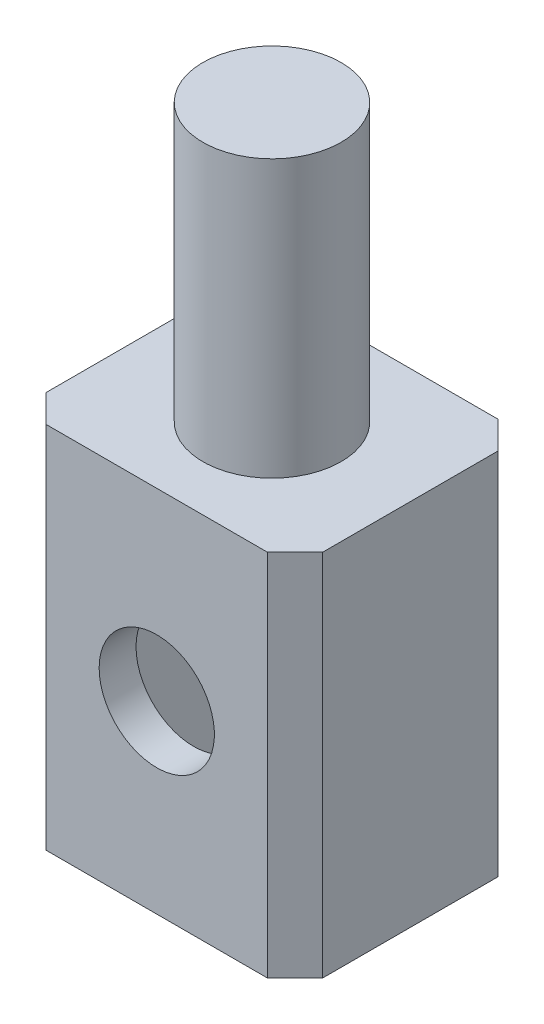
ISO-10303-21;
HEADER;
FILE_DESCRIPTION(('STEP AP214'),'2;1');
FILE_NAME('part.step','',(''),(''),'','','');
FILE_SCHEMA(('AUTOMOTIVE_DESIGN { 1 0 10303 214 1 1 1 1 }'));
ENDSEC;
DATA;
#1=APPLICATION_CONTEXT('core data for automotive mechanical design processes');
#2=APPLICATION_PROTOCOL_DEFINITION('international standard','automotive_design',2000,#1);
#3=PRODUCT_CONTEXT('',#1,'mechanical');
#4=PRODUCT('Part','Part','',(#3));
#5=PRODUCT_RELATED_PRODUCT_CATEGORY('part','',(#4));
#6=PRODUCT_DEFINITION_FORMATION('','',#4);
#7=PRODUCT_DEFINITION_CONTEXT('part definition',#1,'design');
#8=PRODUCT_DEFINITION('design','',#6,#7);
#9=PRODUCT_DEFINITION_SHAPE('','',#8);
#10=(LENGTH_UNIT() NAMED_UNIT(*) SI_UNIT(.MILLI.,.METRE.));
#11=(NAMED_UNIT(*) PLANE_ANGLE_UNIT() SI_UNIT($,.RADIAN.));
#12=(NAMED_UNIT(*) SI_UNIT($,.STERADIAN.) SOLID_ANGLE_UNIT());
#13=UNCERTAINTY_MEASURE_WITH_UNIT(LENGTH_MEASURE(1.E-05),#10,'distance_accuracy_value','');
#14=(GEOMETRIC_REPRESENTATION_CONTEXT(3) GLOBAL_UNCERTAINTY_ASSIGNED_CONTEXT((#13)) GLOBAL_UNIT_ASSIGNED_CONTEXT((#10,
#11,#12)) REPRESENTATION_CONTEXT('',''));
#15=CARTESIAN_POINT('',(0.,0.,0.));
#16=DIRECTION('',(0.,0.,1.));
#17=DIRECTION('',(1.,0.,0.));
#18=AXIS2_PLACEMENT_3D('',#15,#16,#17);
#19=CARTESIAN_POINT('',(0.,0.,0.));
#20=DIRECTION('',(0.,-1.,0.));
#21=DIRECTION('',(0.,0.,-1.));
#22=AXIS2_PLACEMENT_3D('',#19,#20,#21);
#23=PLANE('',#22);
#24=DIRECTION('',(1.,0.,0.));
#25=VECTOR('',#24,1.);
#26=CARTESIAN_POINT('',(0.,0.,0.));
#27=LINE('',#26,#25);
#28=CARTESIAN_POINT('',(7.61999999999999,0.,0.));
#29=VERTEX_POINT('',#28);
#30=CARTESIAN_POINT('',(68.5799999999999,0.,0.));
#31=VERTEX_POINT('',#30);
#32=EDGE_CURVE('E164',#29,#31,#27,.T.);
#33=ORIENTED_EDGE('',*,*,#32,.F.);
#34=DIRECTION('',(0.707106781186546,0.,0.707106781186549));
#35=VECTOR('',#34,1.);
#36=CARTESIAN_POINT('',(3.81000000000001,0.,-3.80999999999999));
#37=LINE('',#36,#35);
#38=CARTESIAN_POINT('',(0.,0.,-7.62000000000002));
#39=VERTEX_POINT('',#38);
#40=EDGE_CURVE('E214',#29,#39,#37,.F.);
#41=ORIENTED_EDGE('',*,*,#40,.T.);
#42=DIRECTION('',(0.,0.,1.));
#43=VECTOR('',#42,1.);
#44=CARTESIAN_POINT('',(0.,0.,0.));
#45=LINE('',#44,#43);
#46=CARTESIAN_POINT('',(0.,0.,-55.88));
#47=VERTEX_POINT('',#46);
#48=EDGE_CURVE('E160',#47,#39,#45,.T.);
#49=ORIENTED_EDGE('',*,*,#48,.F.);
#50=DIRECTION('',(-0.707106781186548,0.,0.707106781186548));
#51=VECTOR('',#50,1.);
#52=CARTESIAN_POINT('',(-27.94,0.,-27.94));
#53=LINE('',#52,#51);
#54=CARTESIAN_POINT('',(7.62000000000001,0.,-63.5));
#55=VERTEX_POINT('',#54);
#56=EDGE_CURVE('E212',#47,#55,#53,.F.);
#57=ORIENTED_EDGE('',*,*,#56,.T.);
#58=DIRECTION('',(-1.,0.,0.));
#59=VECTOR('',#58,1.);
#60=CARTESIAN_POINT('',(0.,0.,-63.5));
#61=LINE('',#60,#59);
#62=CARTESIAN_POINT('',(68.58,0.,-63.5));
#63=VERTEX_POINT('',#62);
#64=EDGE_CURVE('E190',#63,#55,#61,.T.);
#65=ORIENTED_EDGE('',*,*,#64,.F.);
#66=DIRECTION('',(-0.707106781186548,0.,-0.707106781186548));
#67=VECTOR('',#66,1.);
#68=CARTESIAN_POINT('',(66.04,0.,-66.04));
#69=LINE('',#68,#67);
#70=CARTESIAN_POINT('',(76.2,0.,-55.88));
#71=VERTEX_POINT('',#70);
#72=EDGE_CURVE('E210',#63,#71,#69,.F.);
#73=ORIENTED_EDGE('',*,*,#72,.T.);
#74=DIRECTION('',(0.,0.,-1.));
#75=VECTOR('',#74,1.);
#76=CARTESIAN_POINT('',(76.2,0.,0.));
#77=LINE('',#76,#75);
#78=CARTESIAN_POINT('',(76.2,0.,-7.62000000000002));
#79=VERTEX_POINT('',#78);
#80=EDGE_CURVE('E199',#79,#71,#77,.T.);
#81=ORIENTED_EDGE('',*,*,#80,.F.);
#82=DIRECTION('',(0.707106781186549,0.,-0.707106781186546));
#83=VECTOR('',#82,1.);
#84=CARTESIAN_POINT('',(34.2899999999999,0.,34.29));
#85=LINE('',#84,#83);
#86=EDGE_CURVE('E208',#79,#31,#85,.F.);
#87=ORIENTED_EDGE('',*,*,#86,.T.);
#88=EDGE_LOOP('',(#33,#41,#49,#57,#65,#73,#81,#87));
#89=FACE_BOUND('',#88,.T.);
#90=DIRECTION('',(-1.,0.,0.));
#91=VECTOR('',#90,1.);
#92=CARTESIAN_POINT('',(0.,0.,-53.34));
#93=LINE('',#92,#91);
#94=CARTESIAN_POINT('',(66.04,0.,-53.34));
#95=VERTEX_POINT('',#94);
#96=CARTESIAN_POINT('',(10.16,0.,-53.34));
#97=VERTEX_POINT('',#96);
#98=EDGE_CURVE('E155',#95,#97,#93,.T.);
#99=ORIENTED_EDGE('',*,*,#98,.T.);
#100=DIRECTION('',(0.,0.,1.));
#101=VECTOR('',#100,1.);
#102=CARTESIAN_POINT('',(10.16,0.,0.));
#103=LINE('',#102,#101);
#104=CARTESIAN_POINT('',(10.16,0.,-10.16));
#105=VERTEX_POINT('',#104);
#106=EDGE_CURVE('E177',#97,#105,#103,.T.);
#107=ORIENTED_EDGE('',*,*,#106,.T.);
#108=DIRECTION('',(1.,0.,0.));
#109=VECTOR('',#108,1.);
#110=CARTESIAN_POINT('',(0.,0.,-10.16));
#111=LINE('',#110,#109);
#112=CARTESIAN_POINT('',(66.04,0.,-10.16));
#113=VERTEX_POINT('',#112);
#114=EDGE_CURVE('E159',#105,#113,#111,.T.);
#115=ORIENTED_EDGE('',*,*,#114,.T.);
#116=DIRECTION('',(0.,0.,-1.));
#117=VECTOR('',#116,1.);
#118=CARTESIAN_POINT('',(66.04,0.,0.));
#119=LINE('',#118,#117);
#120=EDGE_CURVE('E182',#113,#95,#119,.T.);
#121=ORIENTED_EDGE('',*,*,#120,.T.);
#122=EDGE_LOOP('',(#99,#107,#115,#121));
#123=FACE_BOUND('',#122,.T.);
#124=ADVANCED_FACE('F44',(#89,#123),#23,.T.);
#125=CARTESIAN_POINT('',(0.,101.6,0.));
#126=DIRECTION('',(1.,0.,0.));
#127=DIRECTION('',(0.,0.,-1.));
#128=AXIS2_PLACEMENT_3D('',#125,#126,#127);
#129=PLANE('',#128);
#130=ORIENTED_EDGE('',*,*,#48,.T.);
#131=DIRECTION('',(0.,1.,0.));
#132=VECTOR('',#131,1.);
#133=CARTESIAN_POINT('',(0.,101.6,-7.62000000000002));
#134=LINE('',#133,#132);
#135=CARTESIAN_POINT('',(0.,101.6,-7.62000000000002));
#136=VERTEX_POINT('',#135);
#137=EDGE_CURVE('E219',#39,#136,#134,.T.);
#138=ORIENTED_EDGE('',*,*,#137,.T.);
#139=DIRECTION('',(0.,0.,1.));
#140=VECTOR('',#139,1.);
#141=CARTESIAN_POINT('',(0.,101.6,0.));
#142=LINE('',#141,#140);
#143=CARTESIAN_POINT('',(0.,101.6,-55.88));
#144=VERTEX_POINT('',#143);
#145=EDGE_CURVE('E186',#144,#136,#142,.T.);
#146=ORIENTED_EDGE('',*,*,#145,.F.);
#147=DIRECTION('',(0.,-1.,0.));
#148=VECTOR('',#147,1.);
#149=CARTESIAN_POINT('',(0.,101.6,-55.88));
#150=LINE('',#149,#148);
#151=EDGE_CURVE('E216',#144,#47,#150,.T.);
#152=ORIENTED_EDGE('',*,*,#151,.T.);
#153=EDGE_LOOP('',(#130,#138,#146,#152));
#154=FACE_BOUND('',#153,.T.);
#155=ADVANCED_FACE('F257',(#154),#129,.F.);
#156=CARTESIAN_POINT('',(0.,101.6,0.));
#157=DIRECTION('',(0.,0.,-1.));
#158=DIRECTION('',(-1.,0.,0.));
#159=AXIS2_PLACEMENT_3D('',#156,#157,#158);
#160=PLANE('',#159);
#161=CARTESIAN_POINT('',(38.1,50.8,0.));
#162=DIRECTION('',(0.,0.,-1.));
#163=DIRECTION('',(-1.,0.,0.));
#164=AXIS2_PLACEMENT_3D('',#161,#162,#163);
#165=CIRCLE('',#164,15.875);
#166=CARTESIAN_POINT('',(22.225,50.8,0.));
#167=VERTEX_POINT('',#166);
#168=EDGE_CURVE('E433',#167,#167,#165,.F.);
#169=ORIENTED_EDGE('',*,*,#168,.F.);
#170=EDGE_LOOP('',(#169));
#171=FACE_BOUND('',#170,.T.);
#172=DIRECTION('',(1.,0.,0.));
#173=VECTOR('',#172,1.);
#174=CARTESIAN_POINT('',(0.,101.6,0.));
#175=LINE('',#174,#173);
#176=CARTESIAN_POINT('',(7.61999999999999,101.6,0.));
#177=VERTEX_POINT('',#176);
#178=CARTESIAN_POINT('',(68.5799999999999,101.6,0.));
#179=VERTEX_POINT('',#178);
#180=EDGE_CURVE('E189',#177,#179,#175,.T.);
#181=ORIENTED_EDGE('',*,*,#180,.F.);
#182=DIRECTION('',(0.,-1.,0.));
#183=VECTOR('',#182,1.);
#184=CARTESIAN_POINT('',(7.61999999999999,101.6,0.));
#185=LINE('',#184,#183);
#186=EDGE_CURVE('E205',#177,#29,#185,.T.);
#187=ORIENTED_EDGE('',*,*,#186,.T.);
#188=ORIENTED_EDGE('',*,*,#32,.T.);
#189=DIRECTION('',(0.,1.,0.));
#190=VECTOR('',#189,1.);
#191=CARTESIAN_POINT('',(68.58,101.6,0.));
#192=LINE('',#191,#190);
#193=EDGE_CURVE('E203',#31,#179,#192,.T.);
#194=ORIENTED_EDGE('',*,*,#193,.T.);
#195=EDGE_LOOP('',(#181,#187,#188,#194));
#196=FACE_BOUND('',#195,.T.);
#197=ADVANCED_FACE('F265',(#171,#196),#160,.F.);
#198=CARTESIAN_POINT('',(76.2,101.6,0.));
#199=DIRECTION('',(-1.,0.,0.));
#200=DIRECTION('',(0.,0.,1.));
#201=AXIS2_PLACEMENT_3D('',#198,#199,#200);
#202=PLANE('',#201);
#203=ORIENTED_EDGE('',*,*,#80,.T.);
#204=DIRECTION('',(0.,1.,0.));
#205=VECTOR('',#204,1.);
#206=CARTESIAN_POINT('',(76.2,101.6,-55.88));
#207=LINE('',#206,#205);
#208=CARTESIAN_POINT('',(76.2,101.6,-55.88));
#209=VERTEX_POINT('',#208);
#210=EDGE_CURVE('E11',#71,#209,#207,.T.);
#211=ORIENTED_EDGE('',*,*,#210,.T.);
#212=DIRECTION('',(0.,0.,-1.));
#213=VECTOR('',#212,1.);
#214=CARTESIAN_POINT('',(76.2,101.6,0.));
#215=LINE('',#214,#213);
#216=CARTESIAN_POINT('',(76.2,101.6,-7.62000000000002));
#217=VERTEX_POINT('',#216);
#218=EDGE_CURVE('E193',#217,#209,#215,.T.);
#219=ORIENTED_EDGE('',*,*,#218,.F.);
#220=DIRECTION('',(0.,-1.,0.));
#221=VECTOR('',#220,1.);
#222=CARTESIAN_POINT('',(76.2,101.6,-7.62000000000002));
#223=LINE('',#222,#221);
#224=EDGE_CURVE('E54',#217,#79,#223,.T.);
#225=ORIENTED_EDGE('',*,*,#224,.T.);
#226=EDGE_LOOP('',(#203,#211,#219,#225));
#227=FACE_BOUND('',#226,.T.);
#228=ADVANCED_FACE('F237',(#227),#202,.F.);
#229=CARTESIAN_POINT('',(0.,101.6,-63.5));
#230=DIRECTION('',(0.,0.,1.));
#231=DIRECTION('',(1.,0.,0.));
#232=AXIS2_PLACEMENT_3D('',#229,#230,#231);
#233=PLANE('',#232);
#234=ORIENTED_EDGE('',*,*,#64,.T.);
#235=DIRECTION('',(0.,1.,0.));
#236=VECTOR('',#235,1.);
#237=CARTESIAN_POINT('',(7.62000000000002,101.6,-63.5));
#238=LINE('',#237,#236);
#239=CARTESIAN_POINT('',(7.62000000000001,101.6,-63.5));
#240=VERTEX_POINT('',#239);
#241=EDGE_CURVE('E61',#55,#240,#238,.T.);
#242=ORIENTED_EDGE('',*,*,#241,.T.);
#243=DIRECTION('',(-1.,0.,0.));
#244=VECTOR('',#243,1.);
#245=CARTESIAN_POINT('',(0.,101.6,-63.5));
#246=LINE('',#245,#244);
#247=CARTESIAN_POINT('',(68.58,101.6,-63.5));
#248=VERTEX_POINT('',#247);
#249=EDGE_CURVE('E195',#248,#240,#246,.T.);
#250=ORIENTED_EDGE('',*,*,#249,.F.);
#251=DIRECTION('',(0.,-1.,0.));
#252=VECTOR('',#251,1.);
#253=CARTESIAN_POINT('',(68.58,101.6,-63.5));
#254=LINE('',#253,#252);
#255=EDGE_CURVE('E228',#248,#63,#254,.T.);
#256=ORIENTED_EDGE('',*,*,#255,.T.);
#257=EDGE_LOOP('',(#234,#242,#250,#256));
#258=FACE_BOUND('',#257,.T.);
#259=ADVANCED_FACE('F248',(#258),#233,.F.);
#260=CARTESIAN_POINT('',(0.,101.6,0.));
#261=DIRECTION('',(0.,-1.,0.));
#262=DIRECTION('',(0.,0.,-1.));
#263=AXIS2_PLACEMENT_3D('',#260,#261,#262);
#264=PLANE('',#263);
#265=CARTESIAN_POINT('',(38.1,101.6,-31.75));
#266=DIRECTION('',(0.,1.,0.));
#267=DIRECTION('',(0.,0.,1.));
#268=AXIS2_PLACEMENT_3D('',#265,#266,#267);
#269=CIRCLE('',#268,19.05);
#270=CARTESIAN_POINT('',(38.1,101.6,-50.8));
#271=VERTEX_POINT('',#270);
#272=EDGE_CURVE('E169',#271,#271,#269,.T.);
#273=ORIENTED_EDGE('',*,*,#272,.F.);
#274=EDGE_LOOP('',(#273));
#275=FACE_BOUND('',#274,.T.);
#276=ORIENTED_EDGE('',*,*,#145,.T.);
#277=DIRECTION('',(-0.707106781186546,0.,-0.707106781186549));
#278=VECTOR('',#277,1.);
#279=CARTESIAN_POINT('',(7.61999999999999,101.6,0.));
#280=LINE('',#279,#278);
#281=EDGE_CURVE('E226',#136,#177,#280,.F.);
#282=ORIENTED_EDGE('',*,*,#281,.T.);
#283=ORIENTED_EDGE('',*,*,#180,.T.);
#284=DIRECTION('',(-0.707106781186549,0.,0.707106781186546));
#285=VECTOR('',#284,1.);
#286=CARTESIAN_POINT('',(76.2,101.6,-7.62000000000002));
#287=LINE('',#286,#285);
#288=EDGE_CURVE('E221',#179,#217,#287,.F.);
#289=ORIENTED_EDGE('',*,*,#288,.T.);
#290=ORIENTED_EDGE('',*,*,#218,.T.);
#291=DIRECTION('',(0.707106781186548,0.,0.707106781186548));
#292=VECTOR('',#291,1.);
#293=CARTESIAN_POINT('',(68.58,101.6,-63.5));
#294=LINE('',#293,#292);
#295=EDGE_CURVE('E68',#209,#248,#294,.F.);
#296=ORIENTED_EDGE('',*,*,#295,.T.);
#297=ORIENTED_EDGE('',*,*,#249,.T.);
#298=DIRECTION('',(0.707106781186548,0.,-0.707106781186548));
#299=VECTOR('',#298,1.);
#300=CARTESIAN_POINT('',(0.,101.6,-55.88));
#301=LINE('',#300,#299);
#302=EDGE_CURVE('E224',#240,#144,#301,.F.);
#303=ORIENTED_EDGE('',*,*,#302,.T.);
#304=EDGE_LOOP('',(#276,#282,#283,#289,#290,#296,#297,#303));
#305=FACE_BOUND('',#304,.T.);
#306=ADVANCED_FACE('F250',(#275,#305),#264,.F.);
#307=CARTESIAN_POINT('',(10.16,101.6,0.));
#308=DIRECTION('',(1.,0.,0.));
#309=DIRECTION('',(0.,0.,-1.));
#310=AXIS2_PLACEMENT_3D('',#307,#308,#309);
#311=PLANE('',#310);
#312=ORIENTED_EDGE('',*,*,#106,.F.);
#313=DIRECTION('',(0.,-1.,0.));
#314=VECTOR('',#313,1.);
#315=CARTESIAN_POINT('',(10.16,101.6,-53.34));
#316=LINE('',#315,#314);
#317=CARTESIAN_POINT('',(10.16,91.44,-53.34));
#318=VERTEX_POINT('',#317);
#319=EDGE_CURVE('E154',#318,#97,#316,.T.);
#320=ORIENTED_EDGE('',*,*,#319,.F.);
#321=DIRECTION('',(0.,0.,1.));
#322=VECTOR('',#321,1.);
#323=CARTESIAN_POINT('',(10.16,91.44,0.));
#324=LINE('',#323,#322);
#325=CARTESIAN_POINT('',(10.16,91.44,-10.16));
#326=VERTEX_POINT('',#325);
#327=EDGE_CURVE('E140',#318,#326,#324,.T.);
#328=ORIENTED_EDGE('',*,*,#327,.T.);
#329=DIRECTION('',(0.,-1.,0.));
#330=VECTOR('',#329,1.);
#331=CARTESIAN_POINT('',(10.16,101.6,-10.16));
#332=LINE('',#331,#330);
#333=EDGE_CURVE('E152',#326,#105,#332,.T.);
#334=ORIENTED_EDGE('',*,*,#333,.T.);
#335=EDGE_LOOP('',(#312,#320,#328,#334));
#336=FACE_BOUND('',#335,.T.);
#337=ADVANCED_FACE('F151',(#336),#311,.T.);
#338=CARTESIAN_POINT('',(0.,101.6,-10.16));
#339=DIRECTION('',(0.,0.,-1.));
#340=DIRECTION('',(-1.,0.,0.));
#341=AXIS2_PLACEMENT_3D('',#338,#339,#340);
#342=PLANE('',#341);
#343=CARTESIAN_POINT('',(38.1,50.8,-10.16));
#344=DIRECTION('',(0.,0.,-1.));
#345=DIRECTION('',(-1.,0.,0.));
#346=AXIS2_PLACEMENT_3D('',#343,#344,#345);
#347=CIRCLE('',#346,15.875);
#348=CARTESIAN_POINT('',(22.225,50.8,-10.16));
#349=VERTEX_POINT('',#348);
#350=EDGE_CURVE('E49',#349,#349,#347,.F.);
#351=ORIENTED_EDGE('',*,*,#350,.T.);
#352=EDGE_LOOP('',(#351));
#353=FACE_BOUND('',#352,.T.);
#354=ORIENTED_EDGE('',*,*,#114,.F.);
#355=ORIENTED_EDGE('',*,*,#333,.F.);
#356=DIRECTION('',(1.,0.,0.));
#357=VECTOR('',#356,1.);
#358=CARTESIAN_POINT('',(0.,91.44,-10.16));
#359=LINE('',#358,#357);
#360=CARTESIAN_POINT('',(66.04,91.44,-10.16));
#361=VERTEX_POINT('',#360);
#362=EDGE_CURVE('E136',#326,#361,#359,.T.);
#363=ORIENTED_EDGE('',*,*,#362,.T.);
#364=DIRECTION('',(0.,-1.,0.));
#365=VECTOR('',#364,1.);
#366=CARTESIAN_POINT('',(66.04,101.6,-10.16));
#367=LINE('',#366,#365);
#368=EDGE_CURVE('E161',#361,#113,#367,.T.);
#369=ORIENTED_EDGE('',*,*,#368,.T.);
#370=EDGE_LOOP('',(#354,#355,#363,#369));
#371=FACE_BOUND('',#370,.T.);
#372=ADVANCED_FACE('F157',(#353,#371),#342,.T.);
#373=CARTESIAN_POINT('',(66.04,101.6,0.));
#374=DIRECTION('',(-1.,0.,0.));
#375=DIRECTION('',(0.,0.,1.));
#376=AXIS2_PLACEMENT_3D('',#373,#374,#375);
#377=PLANE('',#376);
#378=ORIENTED_EDGE('',*,*,#120,.F.);
#379=ORIENTED_EDGE('',*,*,#368,.F.);
#380=DIRECTION('',(0.,0.,-1.));
#381=VECTOR('',#380,1.);
#382=CARTESIAN_POINT('',(66.04,91.44,0.));
#383=LINE('',#382,#381);
#384=CARTESIAN_POINT('',(66.04,91.44,-53.34));
#385=VERTEX_POINT('',#384);
#386=EDGE_CURVE('E141',#361,#385,#383,.T.);
#387=ORIENTED_EDGE('',*,*,#386,.T.);
#388=DIRECTION('',(0.,-1.,0.));
#389=VECTOR('',#388,1.);
#390=CARTESIAN_POINT('',(66.04,101.6,-53.34));
#391=LINE('',#390,#389);
#392=EDGE_CURVE('E166',#385,#95,#391,.T.);
#393=ORIENTED_EDGE('',*,*,#392,.T.);
#394=EDGE_LOOP('',(#378,#379,#387,#393));
#395=FACE_BOUND('',#394,.T.);
#396=ADVANCED_FACE('F334',(#395),#377,.T.);
#397=CARTESIAN_POINT('',(0.,101.6,-53.34));
#398=DIRECTION('',(0.,0.,1.));
#399=DIRECTION('',(1.,0.,0.));
#400=AXIS2_PLACEMENT_3D('',#397,#398,#399);
#401=PLANE('',#400);
#402=ORIENTED_EDGE('',*,*,#98,.F.);
#403=ORIENTED_EDGE('',*,*,#392,.F.);
#404=DIRECTION('',(-1.,0.,0.));
#405=VECTOR('',#404,1.);
#406=CARTESIAN_POINT('',(0.,91.44,-53.34));
#407=LINE('',#406,#405);
#408=EDGE_CURVE('E172',#385,#318,#407,.T.);
#409=ORIENTED_EDGE('',*,*,#408,.T.);
#410=ORIENTED_EDGE('',*,*,#319,.T.);
#411=EDGE_LOOP('',(#402,#403,#409,#410));
#412=FACE_BOUND('',#411,.T.);
#413=ADVANCED_FACE('F385',(#412),#401,.T.);
#414=CARTESIAN_POINT('',(0.,91.44,0.));
#415=DIRECTION('',(0.,-1.,0.));
#416=DIRECTION('',(0.,0.,-1.));
#417=AXIS2_PLACEMENT_3D('',#414,#415,#416);
#418=PLANE('',#417);
#419=ORIENTED_EDGE('',*,*,#327,.F.);
#420=ORIENTED_EDGE('',*,*,#408,.F.);
#421=ORIENTED_EDGE('',*,*,#386,.F.);
#422=ORIENTED_EDGE('',*,*,#362,.F.);
#423=EDGE_LOOP('',(#419,#420,#421,#422));
#424=FACE_BOUND('',#423,.T.);
#425=ADVANCED_FACE('F138',(#424),#418,.T.);
#426=CARTESIAN_POINT('',(38.1,177.8,-31.75));
#427=DIRECTION('',(0.,-1.,0.));
#428=DIRECTION('',(0.,0.,-1.));
#429=AXIS2_PLACEMENT_3D('',#426,#427,#428);
#430=CYLINDRICAL_SURFACE('',#429,19.05);
#431=CARTESIAN_POINT('',(38.1,177.8,-31.75));
#432=DIRECTION('',(0.,1.,0.));
#433=DIRECTION('',(0.,0.,1.));
#434=AXIS2_PLACEMENT_3D('',#431,#432,#433);
#435=CIRCLE('',#434,19.05);
#436=CARTESIAN_POINT('',(38.1,177.8,-50.8));
#437=VERTEX_POINT('',#436);
#438=EDGE_CURVE('E179',#437,#437,#435,.T.);
#439=CARTESIAN_POINT('',(38.1,177.8,-50.8));
#440=CARTESIAN_POINT('',(38.1,177.00625,-50.8));
#441=CARTESIAN_POINT('',(38.1,176.2125,-50.8));
#442=CARTESIAN_POINT('',(38.1,174.625,-50.8));
#443=CARTESIAN_POINT('',(38.1,173.83125,-50.8));
#444=CARTESIAN_POINT('',(38.1,172.24375,-50.8));
#445=CARTESIAN_POINT('',(38.1,171.45,-50.8));
#446=CARTESIAN_POINT('',(38.1,169.8625,-50.8));
#447=CARTESIAN_POINT('',(38.1,169.06875,-50.8));
#448=CARTESIAN_POINT('',(38.1,167.48125,-50.8));
#449=CARTESIAN_POINT('',(38.1,166.6875,-50.8));
#450=CARTESIAN_POINT('',(38.1,165.1,-50.8));
#451=CARTESIAN_POINT('',(38.1,164.30625,-50.8));
#452=CARTESIAN_POINT('',(38.1,162.71875,-50.8));
#453=CARTESIAN_POINT('',(38.1,161.925,-50.8));
#454=CARTESIAN_POINT('',(38.1,160.3375,-50.8));
#455=CARTESIAN_POINT('',(38.1,159.54375,-50.8));
#456=CARTESIAN_POINT('',(38.1,157.95625,-50.8));
#457=CARTESIAN_POINT('',(38.1,157.1625,-50.8));
#458=CARTESIAN_POINT('',(38.1,155.575,-50.8));
#459=CARTESIAN_POINT('',(38.1,154.78125,-50.8));
#460=CARTESIAN_POINT('',(38.1,153.19375,-50.8));
#461=CARTESIAN_POINT('',(38.1,152.4,-50.8));
#462=CARTESIAN_POINT('',(38.1,150.8125,-50.8));
#463=CARTESIAN_POINT('',(38.1,150.01875,-50.8));
#464=CARTESIAN_POINT('',(38.1,148.43125,-50.8));
#465=CARTESIAN_POINT('',(38.1,147.6375,-50.8));
#466=CARTESIAN_POINT('',(38.1,146.05,-50.8));
#467=CARTESIAN_POINT('',(38.1,145.25625,-50.8));
#468=CARTESIAN_POINT('',(38.1,143.66875,-50.8));
#469=CARTESIAN_POINT('',(38.1,142.875,-50.8));
#470=CARTESIAN_POINT('',(38.1,141.2875,-50.8));
#471=CARTESIAN_POINT('',(38.1,140.49375,-50.8));
#472=CARTESIAN_POINT('',(38.1,138.90625,-50.8));
#473=CARTESIAN_POINT('',(38.1,138.1125,-50.8));
#474=CARTESIAN_POINT('',(38.1,136.525,-50.8));
#475=CARTESIAN_POINT('',(38.1,135.73125,-50.8));
#476=CARTESIAN_POINT('',(38.1,134.14375,-50.8));
#477=CARTESIAN_POINT('',(38.1,133.35,-50.8));
#478=CARTESIAN_POINT('',(38.1,131.7625,-50.8));
#479=CARTESIAN_POINT('',(38.1,130.96875,-50.8));
#480=CARTESIAN_POINT('',(38.1,129.38125,-50.8));
#481=CARTESIAN_POINT('',(38.1,128.5875,-50.8));
#482=CARTESIAN_POINT('',(38.1,127.,-50.8));
#483=CARTESIAN_POINT('',(38.1,126.20625,-50.8));
#484=CARTESIAN_POINT('',(38.1,124.61875,-50.8));
#485=CARTESIAN_POINT('',(38.1,123.825,-50.8));
#486=CARTESIAN_POINT('',(38.1,122.2375,-50.8));
#487=CARTESIAN_POINT('',(38.1,121.44375,-50.8));
#488=CARTESIAN_POINT('',(38.1,119.85625,-50.8));
#489=CARTESIAN_POINT('',(38.1,119.0625,-50.8));
#490=CARTESIAN_POINT('',(38.1,117.475,-50.8));
#491=CARTESIAN_POINT('',(38.1,116.68125,-50.8));
#492=CARTESIAN_POINT('',(38.1,115.09375,-50.8));
#493=CARTESIAN_POINT('',(38.1,114.3,-50.8));
#494=CARTESIAN_POINT('',(38.1,112.7125,-50.8));
#495=CARTESIAN_POINT('',(38.1,111.91875,-50.8));
#496=CARTESIAN_POINT('',(38.1,110.33125,-50.8));
#497=CARTESIAN_POINT('',(38.1,109.5375,-50.8));
#498=CARTESIAN_POINT('',(38.1,107.95,-50.8));
#499=CARTESIAN_POINT('',(38.1,107.15625,-50.8));
#500=CARTESIAN_POINT('',(38.1,105.56875,-50.8));
#501=CARTESIAN_POINT('',(38.1,104.775,-50.8));
#502=CARTESIAN_POINT('',(38.1,103.1875,-50.8));
#503=CARTESIAN_POINT('',(38.1,102.39375,-50.8));
#504=CARTESIAN_POINT('',(38.1,101.6,-50.8));
#505=B_SPLINE_CURVE_WITH_KNOTS('',3,(#439,#440,#441,#442,#443,#444,#445,#446,#447,#448,#449,
#450,#451,#452,#453,#454,#455,#456,#457,#458,#459,#460,#461,#462,#463,#464,#465,#466,#467,#468,
#469,#470,#471,#472,#473,#474,#475,#476,#477,#478,#479,#480,#481,#482,#483,#484,#485,#486,#487,
#488,#489,#490,#491,#492,#493,#494,#495,#496,#497,#498,#499,#500,#501,#502,#503,#504),
.UNSPECIFIED.,.F.,.F.,(4,2,2,2,2,2,2,2,2,2,2,2,2,2,2,2,2,2,2,2,2,2,2,2,2,2,2,2,2,2,2,2,4),(0.,
2.38125,4.7625,7.14375,9.52500000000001,11.90625,14.2875,16.66875,19.05,21.43125,23.8125,
26.19375,28.575,30.95625,33.3375,35.71875,38.1,40.48125,42.8625,45.24375,47.625,50.00625,
52.3875,54.76875,57.15,59.53125,61.9125,64.29375,66.675,69.05625,71.4375,73.81875,76.2),.UNSPECIFIED.);
#506=EDGE_CURVE('BSEAM402',#437,#271,#505,.T.);
#507=ORIENTED_EDGE('',*,*,#438,.F.);
#508=ORIENTED_EDGE('',*,*,#272,.T.);
#509=ORIENTED_EDGE('',*,*,#506,.T.);
#510=ORIENTED_EDGE('',*,*,#506,.F.);
#511=EDGE_LOOP('',(#507,#509,#508,#510));
#512=FACE_BOUND('',#511,.T.);
#513=ADVANCED_FACE('F402',(#512),#430,.T.);
#514=CARTESIAN_POINT('',(38.1,177.8,-31.75));
#515=DIRECTION('',(0.,1.,0.));
#516=DIRECTION('',(0.,0.,1.));
#517=AXIS2_PLACEMENT_3D('',#514,#515,#516);
#518=PLANE('',#517);
#519=ORIENTED_EDGE('',*,*,#438,.T.);
#520=EDGE_LOOP('',(#519));
#521=FACE_BOUND('',#520,.T.);
#522=ADVANCED_FACE('F298',(#521),#518,.T.);
#523=CARTESIAN_POINT('',(7.61999999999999,101.6,0.));
#524=DIRECTION('',(0.707106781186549,0.,-0.707106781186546));
#525=DIRECTION('',(0.,-1.,0.));
#526=AXIS2_PLACEMENT_3D('',#523,#524,#525);
#527=PLANE('',#526);
#528=ORIENTED_EDGE('',*,*,#281,.F.);
#529=ORIENTED_EDGE('',*,*,#137,.F.);
#530=ORIENTED_EDGE('',*,*,#40,.F.);
#531=ORIENTED_EDGE('',*,*,#186,.F.);
#532=EDGE_LOOP('',(#528,#529,#530,#531));
#533=FACE_BOUND('',#532,.T.);
#534=ADVANCED_FACE('F262',(#533),#527,.F.);
#535=CARTESIAN_POINT('',(0.,101.6,-55.88));
#536=DIRECTION('',(0.707106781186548,0.,0.707106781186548));
#537=DIRECTION('',(0.,-1.,0.));
#538=AXIS2_PLACEMENT_3D('',#535,#536,#537);
#539=PLANE('',#538);
#540=ORIENTED_EDGE('',*,*,#302,.F.);
#541=ORIENTED_EDGE('',*,*,#241,.F.);
#542=ORIENTED_EDGE('',*,*,#56,.F.);
#543=ORIENTED_EDGE('',*,*,#151,.F.);
#544=EDGE_LOOP('',(#540,#541,#542,#543));
#545=FACE_BOUND('',#544,.T.);
#546=ADVANCED_FACE('F254',(#545),#539,.F.);
#547=CARTESIAN_POINT('',(68.58,101.6,-63.5));
#548=DIRECTION('',(-0.707106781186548,0.,0.707106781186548));
#549=DIRECTION('',(0.,-1.,0.));
#550=AXIS2_PLACEMENT_3D('',#547,#548,#549);
#551=PLANE('',#550);
#552=ORIENTED_EDGE('',*,*,#295,.F.);
#553=ORIENTED_EDGE('',*,*,#210,.F.);
#554=ORIENTED_EDGE('',*,*,#72,.F.);
#555=ORIENTED_EDGE('',*,*,#255,.F.);
#556=EDGE_LOOP('',(#552,#553,#554,#555));
#557=FACE_BOUND('',#556,.T.);
#558=ADVANCED_FACE('F247',(#557),#551,.F.);
#559=CARTESIAN_POINT('',(76.2,101.6,-7.62000000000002));
#560=DIRECTION('',(-0.707106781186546,0.,-0.707106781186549));
#561=DIRECTION('',(0.,-1.,0.));
#562=AXIS2_PLACEMENT_3D('',#559,#560,#561);
#563=PLANE('',#562);
#564=ORIENTED_EDGE('',*,*,#288,.F.);
#565=ORIENTED_EDGE('',*,*,#193,.F.);
#566=ORIENTED_EDGE('',*,*,#86,.F.);
#567=ORIENTED_EDGE('',*,*,#224,.F.);
#568=EDGE_LOOP('',(#564,#565,#566,#567));
#569=FACE_BOUND('',#568,.T.);
#570=ADVANCED_FACE('F47',(#569),#563,.F.);
#571=CARTESIAN_POINT('',(38.1,50.8,1.2E-05));
#572=DIRECTION('',(0.,0.,-1.));
#573=DIRECTION('',(-1.,0.,0.));
#574=AXIS2_PLACEMENT_3D('',#571,#572,#573);
#575=CYLINDRICAL_SURFACE('',#574,15.875);
#576=CARTESIAN_POINT('',(22.225,50.8,-10.16));
#577=CARTESIAN_POINT('',(22.225,50.8,-10.0541666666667));
#578=CARTESIAN_POINT('',(22.225,50.8,-9.94833333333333));
#579=CARTESIAN_POINT('',(22.225,50.8,-9.73666666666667));
#580=CARTESIAN_POINT('',(22.225,50.8,-9.63083333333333));
#581=CARTESIAN_POINT('',(22.225,50.8,-9.41916666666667));
#582=CARTESIAN_POINT('',(22.225,50.8,-9.31333333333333));
#583=CARTESIAN_POINT('',(22.225,50.8,-9.10166666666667));
#584=CARTESIAN_POINT('',(22.225,50.8,-8.99583333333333));
#585=CARTESIAN_POINT('',(22.225,50.8,-8.78416666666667));
#586=CARTESIAN_POINT('',(22.225,50.8,-8.67833333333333));
#587=CARTESIAN_POINT('',(22.225,50.8,-8.46666666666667));
#588=CARTESIAN_POINT('',(22.225,50.8,-8.36083333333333));
#589=CARTESIAN_POINT('',(22.225,50.8,-8.14916666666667));
#590=CARTESIAN_POINT('',(22.225,50.8,-8.04333333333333));
#591=CARTESIAN_POINT('',(22.225,50.8,-7.83166666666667));
#592=CARTESIAN_POINT('',(22.225,50.8,-7.72583333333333));
#593=CARTESIAN_POINT('',(22.225,50.8,-7.51416666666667));
#594=CARTESIAN_POINT('',(22.225,50.8,-7.40833333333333));
#595=CARTESIAN_POINT('',(22.225,50.8,-7.19666666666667));
#596=CARTESIAN_POINT('',(22.225,50.8,-7.09083333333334));
#597=CARTESIAN_POINT('',(22.225,50.8,-6.87916666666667));
#598=CARTESIAN_POINT('',(22.225,50.8,-6.77333333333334));
#599=CARTESIAN_POINT('',(22.225,50.8,-6.56166666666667));
#600=CARTESIAN_POINT('',(22.225,50.8,-6.45583333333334));
#601=CARTESIAN_POINT('',(22.225,50.8,-6.24416666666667));
#602=CARTESIAN_POINT('',(22.225,50.8,-6.13833333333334));
#603=CARTESIAN_POINT('',(22.225,50.8,-5.92666666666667));
#604=CARTESIAN_POINT('',(22.225,50.8,-5.82083333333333));
#605=CARTESIAN_POINT('',(22.225,50.8,-5.60916666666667));
#606=CARTESIAN_POINT('',(22.225,50.8,-5.50333333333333));
#607=CARTESIAN_POINT('',(22.225,50.8,-5.29166666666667));
#608=CARTESIAN_POINT('',(22.225,50.8,-5.18583333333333));
#609=CARTESIAN_POINT('',(22.225,50.8,-4.97416666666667));
#610=CARTESIAN_POINT('',(22.225,50.8,-4.86833333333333));
#611=CARTESIAN_POINT('',(22.225,50.8,-4.65666666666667));
#612=CARTESIAN_POINT('',(22.225,50.8,-4.55083333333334));
#613=CARTESIAN_POINT('',(22.225,50.8,-4.33916666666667));
#614=CARTESIAN_POINT('',(22.225,50.8,-4.23333333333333));
#615=CARTESIAN_POINT('',(22.225,50.8,-4.02166666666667));
#616=CARTESIAN_POINT('',(22.225,50.8,-3.91583333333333));
#617=CARTESIAN_POINT('',(22.225,50.8,-3.70416666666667));
#618=CARTESIAN_POINT('',(22.225,50.8,-3.59833333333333));
#619=CARTESIAN_POINT('',(22.225,50.8,-3.38666666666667));
#620=CARTESIAN_POINT('',(22.225,50.8,-3.28083333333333));
#621=CARTESIAN_POINT('',(22.225,50.8,-3.06916666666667));
#622=CARTESIAN_POINT('',(22.225,50.8,-2.96333333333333));
#623=CARTESIAN_POINT('',(22.225,50.8,-2.75166666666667));
#624=CARTESIAN_POINT('',(22.225,50.8,-2.64583333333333));
#625=CARTESIAN_POINT('',(22.225,50.8,-2.43416666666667));
#626=CARTESIAN_POINT('',(22.225,50.8,-2.32833333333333));
#627=CARTESIAN_POINT('',(22.225,50.8,-2.11666666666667));
#628=CARTESIAN_POINT('',(22.225,50.8,-2.01083333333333));
#629=CARTESIAN_POINT('',(22.225,50.8,-1.79916666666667));
#630=CARTESIAN_POINT('',(22.225,50.8,-1.69333333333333));
#631=CARTESIAN_POINT('',(22.225,50.8,-1.48166666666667));
#632=CARTESIAN_POINT('',(22.225,50.8,-1.37583333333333));
#633=CARTESIAN_POINT('',(22.225,50.8,-1.16416666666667));
#634=CARTESIAN_POINT('',(22.225,50.8,-1.05833333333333));
#635=CARTESIAN_POINT('',(22.225,50.8,-0.846666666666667));
#636=CARTESIAN_POINT('',(22.225,50.8,-0.740833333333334));
#637=CARTESIAN_POINT('',(22.225,50.8,-0.529166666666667));
#638=CARTESIAN_POINT('',(22.225,50.8,-0.423333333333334));
#639=CARTESIAN_POINT('',(22.225,50.8,-0.211666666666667));
#640=CARTESIAN_POINT('',(22.225,50.8,-0.105833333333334));
#641=CARTESIAN_POINT('',(22.225,50.8,0.));
#642=B_SPLINE_CURVE_WITH_KNOTS('',3,(#576,#577,#578,#579,#580,#581,#582,#583,#584,#585,#586,
#587,#588,#589,#590,#591,#592,#593,#594,#595,#596,#597,#598,#599,#600,#601,#602,#603,#604,#605,
#606,#607,#608,#609,#610,#611,#612,#613,#614,#615,#616,#617,#618,#619,#620,#621,#622,#623,#624,
#625,#626,#627,#628,#629,#630,#631,#632,#633,#634,#635,#636,#637,#638,#639,#640,#641),
.UNSPECIFIED.,.F.,.F.,(4,2,2,2,2,2,2,2,2,2,2,2,2,2,2,2,2,2,2,2,2,2,2,2,2,2,2,2,2,2,2,2,4),(0.,
0.3175,0.635,0.9525,1.27,1.5875,1.905,2.2225,2.54,2.8575,3.175,3.4925,3.81,4.1275,4.445,4.7625,
5.08,5.3975,5.715,6.0325,6.35,6.6675,6.985,7.3025,7.62,7.9375,8.255,8.5725,8.89,9.2075,9.525,
9.8425,10.16),.UNSPECIFIED.);
#643=EDGE_CURVE('BSEAM268',#349,#167,#642,.T.);
#644=ORIENTED_EDGE('',*,*,#350,.F.);
#645=ORIENTED_EDGE('',*,*,#168,.T.);
#646=ORIENTED_EDGE('',*,*,#643,.T.);
#647=ORIENTED_EDGE('',*,*,#643,.F.);
#648=EDGE_LOOP('',(#644,#646,#645,#647));
#649=FACE_BOUND('',#648,.T.);
#650=ADVANCED_FACE('F268',(#649),#575,.F.);
#651=CLOSED_SHELL('',(#124,#155,#197,#228,#259,#306,#337,#372,#396,#413,#425,#513,#522,#534,
#546,#558,#570,#650));
#652=MANIFOLD_SOLID_BREP('B2',#651);
#653=ADVANCED_BREP_SHAPE_REPRESENTATION('',(#18,#652),#14);
#654=SHAPE_DEFINITION_REPRESENTATION(#9,#653);
ENDSEC;
END-ISO-10303-21;
